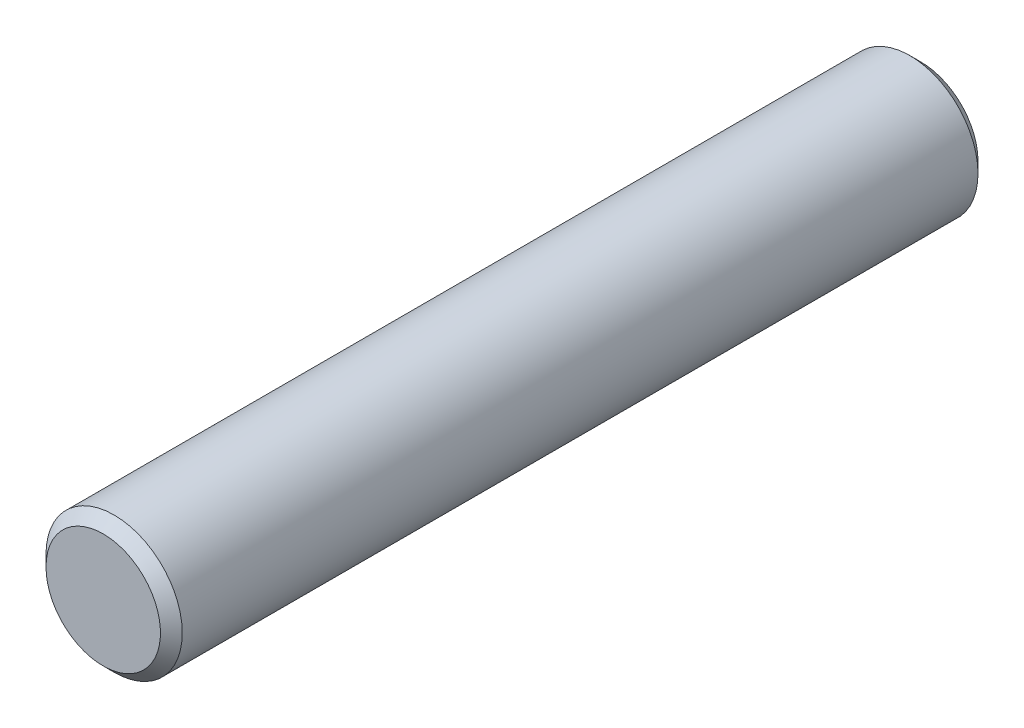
ISO-10303-21;
HEADER;
FILE_DESCRIPTION(('STEP AP214'),'2;1');
FILE_NAME('part.step','',(''),(''),'','','');
FILE_SCHEMA(('AUTOMOTIVE_DESIGN { 1 0 10303 214 1 1 1 1 }'));
ENDSEC;
DATA;
#1=APPLICATION_CONTEXT('core data for automotive mechanical design processes');
#2=APPLICATION_PROTOCOL_DEFINITION('international standard','automotive_design',2000,#1);
#3=PRODUCT_CONTEXT('',#1,'mechanical');
#4=PRODUCT('Part','Part','',(#3));
#5=PRODUCT_RELATED_PRODUCT_CATEGORY('part','',(#4));
#6=PRODUCT_DEFINITION_FORMATION('','',#4);
#7=PRODUCT_DEFINITION_CONTEXT('part definition',#1,'design');
#8=PRODUCT_DEFINITION('design','',#6,#7);
#9=PRODUCT_DEFINITION_SHAPE('','',#8);
#10=(LENGTH_UNIT() NAMED_UNIT(*) SI_UNIT(.MILLI.,.METRE.));
#11=(NAMED_UNIT(*) PLANE_ANGLE_UNIT() SI_UNIT($,.RADIAN.));
#12=(NAMED_UNIT(*) SI_UNIT($,.STERADIAN.) SOLID_ANGLE_UNIT());
#13=UNCERTAINTY_MEASURE_WITH_UNIT(LENGTH_MEASURE(1.E-05),#10,'distance_accuracy_value','');
#14=(GEOMETRIC_REPRESENTATION_CONTEXT(3) GLOBAL_UNCERTAINTY_ASSIGNED_CONTEXT((#13)) GLOBAL_UNIT_ASSIGNED_CONTEXT((#10,
#11,#12)) REPRESENTATION_CONTEXT('',''));
#15=CARTESIAN_POINT('',(0.,0.,0.));
#16=DIRECTION('',(0.,0.,1.));
#17=DIRECTION('',(1.,0.,0.));
#18=AXIS2_PLACEMENT_3D('',#15,#16,#17);
#19=CARTESIAN_POINT('',(0.113636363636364,0.,7.5));
#20=DIRECTION('',(0.,0.,1.));
#21=DIRECTION('',(1.,0.,0.));
#22=AXIS2_PLACEMENT_3D('',#19,#20,#21);
#23=PLANE('',#22);
#24=CARTESIAN_POINT('',(0.,0.,7.50000000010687));
#25=DIRECTION('',(0.,0.,-1.));
#26=DIRECTION('',(-1.,0.,0.));
#27=AXIS2_PLACEMENT_3D('',#24,#25,#26);
#28=CIRCLE('',#27,1.05000000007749);
#29=CARTESIAN_POINT('',(-1.05000000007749,0.,7.50000000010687));
#30=VERTEX_POINT('',#29);
#31=EDGE_CURVE('E17',#30,#30,#28,.T.);
#32=ORIENTED_EDGE('',*,*,#31,.F.);
#33=EDGE_LOOP('',(#32));
#34=FACE_BOUND('',#33,.T.);
#35=ADVANCED_FACE('F13',(#34),#23,.T.);
#36=CARTESIAN_POINT('',(0.113636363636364,0.,-7.5));
#37=DIRECTION('',(0.,0.,1.));
#38=DIRECTION('',(1.,0.,0.));
#39=AXIS2_PLACEMENT_3D('',#36,#37,#38);
#40=PLANE('',#39);
#41=CARTESIAN_POINT('',(0.,0.,-7.50000000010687));
#42=DIRECTION('',(0.,0.,1.));
#43=DIRECTION('',(1.,0.,0.));
#44=AXIS2_PLACEMENT_3D('',#41,#42,#43);
#45=CIRCLE('',#44,1.05000000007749);
#46=CARTESIAN_POINT('',(1.05000000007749,0.,-7.50000000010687));
#47=VERTEX_POINT('',#46);
#48=EDGE_CURVE('E26',#47,#47,#45,.T.);
#49=ORIENTED_EDGE('',*,*,#48,.F.);
#50=EDGE_LOOP('',(#49));
#51=FACE_BOUND('',#50,.T.);
#52=ADVANCED_FACE('F41',(#51),#40,.F.);
#53=CARTESIAN_POINT('',(0.,0.,7.29999999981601));
#54=DIRECTION('',(0.,0.,-1.));
#55=DIRECTION('',(-1.,0.,0.));
#56=AXIS2_PLACEMENT_3D('',#53,#54,#55);
#57=CONICAL_SURFACE('',#56,1.25000000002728,0.785398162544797);
#58=CARTESIAN_POINT('',(0.,0.,7.3));
#59=DIRECTION('',(0.,0.,1.));
#60=DIRECTION('',(1.,0.,0.));
#61=AXIS2_PLACEMENT_3D('',#58,#59,#60);
#62=CIRCLE('',#61,1.25);
#63=CARTESIAN_POINT('',(1.25,0.,7.3));
#64=VERTEX_POINT('',#63);
#65=EDGE_CURVE('E21',#64,#64,#62,.F.);
#66=ORIENTED_EDGE('',*,*,#65,.F.);
#67=EDGE_LOOP('',(#66));
#68=FACE_BOUND('',#67,.T.);
#69=ORIENTED_EDGE('',*,*,#31,.T.);
#70=EDGE_LOOP('',(#69));
#71=FACE_BOUND('',#70,.T.);
#72=ADVANCED_FACE('F38',(#68,#71),#57,.T.);
#73=CARTESIAN_POINT('',(0.,0.,-7.29999999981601));
#74=DIRECTION('',(0.,0.,1.));
#75=DIRECTION('',(1.,0.,0.));
#76=AXIS2_PLACEMENT_3D('',#73,#74,#75);
#77=CONICAL_SURFACE('',#76,1.25000000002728,0.785398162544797);
#78=CARTESIAN_POINT('',(0.,0.,-7.3));
#79=DIRECTION('',(0.,0.,1.));
#80=DIRECTION('',(1.,0.,0.));
#81=AXIS2_PLACEMENT_3D('',#78,#79,#80);
#82=CIRCLE('',#81,1.25);
#83=CARTESIAN_POINT('',(1.25,0.,-7.3));
#84=VERTEX_POINT('',#83);
#85=EDGE_CURVE('E9',#84,#84,#82,.T.);
#86=ORIENTED_EDGE('',*,*,#85,.F.);
#87=EDGE_LOOP('',(#86));
#88=FACE_BOUND('',#87,.T.);
#89=ORIENTED_EDGE('',*,*,#48,.T.);
#90=EDGE_LOOP('',(#89));
#91=FACE_BOUND('',#90,.T.);
#92=ADVANCED_FACE('F50',(#88,#91),#77,.T.);
#93=CARTESIAN_POINT('',(0.,0.,0.));
#94=DIRECTION('',(0.,0.,1.));
#95=DIRECTION('',(1.,0.,0.));
#96=AXIS2_PLACEMENT_3D('',#93,#94,#95);
#97=CYLINDRICAL_SURFACE('',#96,1.25);
#98=ORIENTED_EDGE('',*,*,#85,.T.);
#99=EDGE_LOOP('',(#98));
#100=FACE_BOUND('',#99,.T.);
#101=ORIENTED_EDGE('',*,*,#65,.T.);
#102=EDGE_LOOP('',(#101));
#103=FACE_BOUND('',#102,.T.);
#104=ADVANCED_FACE('F15',(#100,#103),#97,.T.);
#105=CLOSED_SHELL('',(#35,#52,#72,#92,#104));
#106=MANIFOLD_SOLID_BREP('B1',#105);
#107=ADVANCED_BREP_SHAPE_REPRESENTATION('',(#18,#106),#14);
#108=SHAPE_DEFINITION_REPRESENTATION(#9,#107);
ENDSEC;
END-ISO-10303-21;
